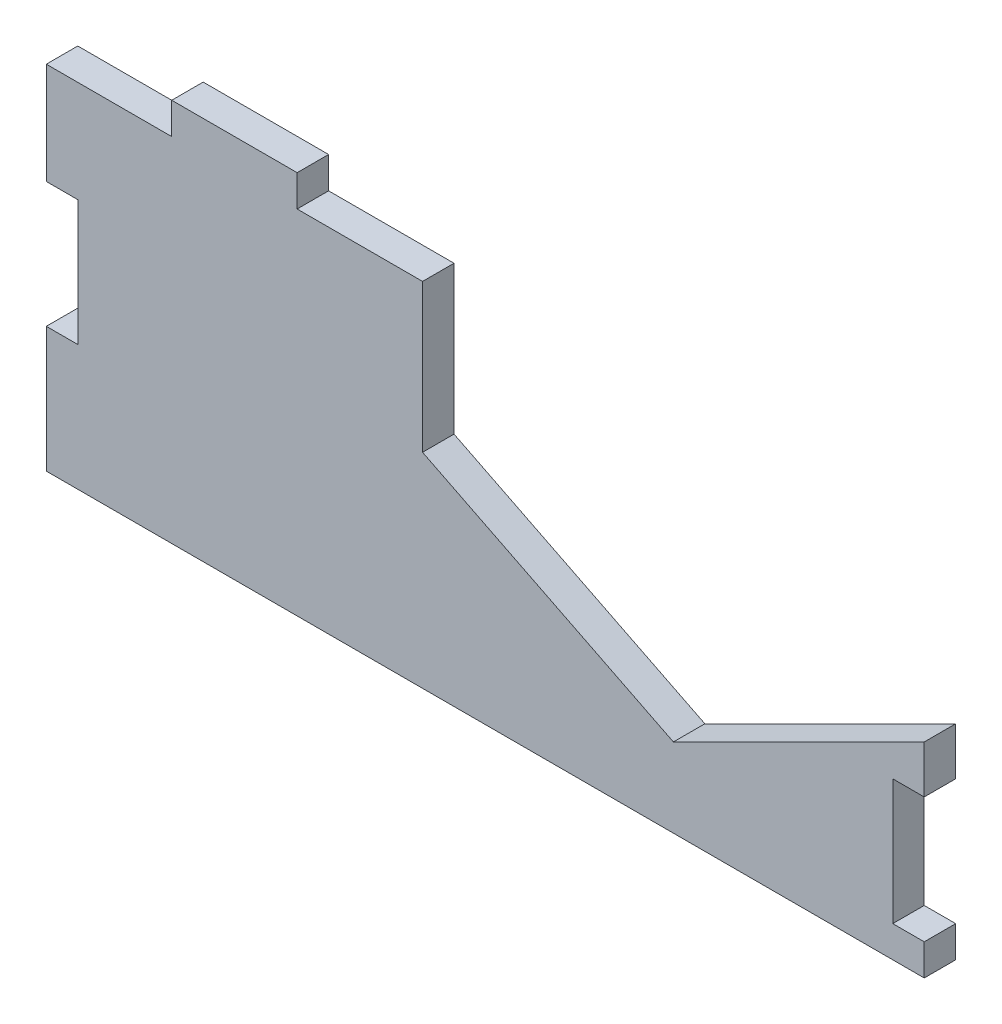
ISO-10303-21;
HEADER;
FILE_DESCRIPTION(('STEP AP214'),'2;1');
FILE_NAME('part.step','',(''),(''),'','','');
FILE_SCHEMA(('AUTOMOTIVE_DESIGN { 1 0 10303 214 1 1 1 1 }'));
ENDSEC;
DATA;
#1=APPLICATION_CONTEXT('core data for automotive mechanical design processes');
#2=APPLICATION_PROTOCOL_DEFINITION('international standard','automotive_design',2000,#1);
#3=PRODUCT_CONTEXT('',#1,'mechanical');
#4=PRODUCT('Part','Part','',(#3));
#5=PRODUCT_RELATED_PRODUCT_CATEGORY('part','',(#4));
#6=PRODUCT_DEFINITION_FORMATION('','',#4);
#7=PRODUCT_DEFINITION_CONTEXT('part definition',#1,'design');
#8=PRODUCT_DEFINITION('design','',#6,#7);
#9=PRODUCT_DEFINITION_SHAPE('','',#8);
#10=(LENGTH_UNIT() NAMED_UNIT(*) SI_UNIT(.MILLI.,.METRE.));
#11=(NAMED_UNIT(*) PLANE_ANGLE_UNIT() SI_UNIT($,.RADIAN.));
#12=(NAMED_UNIT(*) SI_UNIT($,.STERADIAN.) SOLID_ANGLE_UNIT());
#13=UNCERTAINTY_MEASURE_WITH_UNIT(LENGTH_MEASURE(1.E-05),#10,'distance_accuracy_value','');
#14=(GEOMETRIC_REPRESENTATION_CONTEXT(3) GLOBAL_UNCERTAINTY_ASSIGNED_CONTEXT((#13)) GLOBAL_UNIT_ASSIGNED_CONTEXT((#10,
#11,#12)) REPRESENTATION_CONTEXT('',''));
#15=CARTESIAN_POINT('',(0.,0.,0.));
#16=DIRECTION('',(0.,0.,1.));
#17=DIRECTION('',(1.,0.,0.));
#18=AXIS2_PLACEMENT_3D('',#15,#16,#17);
#19=CARTESIAN_POINT('',(89.0643455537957,353.134265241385,19.));
#20=DIRECTION('',(-1.,0.,0.));
#21=DIRECTION('',(0.,-1.,0.));
#22=AXIS2_PLACEMENT_3D('',#19,#20,#21);
#23=PLANE('',#22);
#24=DIRECTION('',(0.,1.,0.));
#25=VECTOR('',#24,1.);
#26=CARTESIAN_POINT('',(89.0643455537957,353.134265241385,0.));
#27=LINE('',#26,#25);
#28=CARTESIAN_POINT('',(89.0643455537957,324.362836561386,0.));
#29=VERTEX_POINT('',#28);
#30=CARTESIAN_POINT('',(89.0643455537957,353.134265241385,0.));
#31=VERTEX_POINT('',#30);
#32=EDGE_CURVE('E194',#29,#31,#27,.T.);
#33=ORIENTED_EDGE('',*,*,#32,.T.);
#34=DIRECTION('',(0.,0.,-1.));
#35=VECTOR('',#34,1.);
#36=CARTESIAN_POINT('',(89.0643455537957,353.134265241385,19.));
#37=LINE('',#36,#35);
#38=CARTESIAN_POINT('',(89.0643455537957,353.134265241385,19.));
#39=VERTEX_POINT('',#38);
#40=EDGE_CURVE('E11',#39,#31,#37,.T.);
#41=ORIENTED_EDGE('',*,*,#40,.F.);
#42=DIRECTION('',(0.,1.,0.));
#43=VECTOR('',#42,1.);
#44=CARTESIAN_POINT('',(89.0643455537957,353.134265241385,19.));
#45=LINE('',#44,#43);
#46=CARTESIAN_POINT('',(89.0643455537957,324.362836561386,19.));
#47=VERTEX_POINT('',#46);
#48=EDGE_CURVE('E230',#47,#39,#45,.T.);
#49=ORIENTED_EDGE('',*,*,#48,.F.);
#50=DIRECTION('',(0.,0.,-1.));
#51=VECTOR('',#50,1.);
#52=CARTESIAN_POINT('',(89.0643455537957,324.362836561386,19.));
#53=LINE('',#52,#51);
#54=EDGE_CURVE('E190',#47,#29,#53,.T.);
#55=ORIENTED_EDGE('',*,*,#54,.T.);
#56=EDGE_LOOP('',(#33,#41,#49,#55));
#57=FACE_BOUND('',#56,.T.);
#58=ADVANCED_FACE('F32',(#57),#23,.F.);
#59=CARTESIAN_POINT('',(89.0643455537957,353.134265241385,19.));
#60=DIRECTION('',(0.447213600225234,-0.894427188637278,0.));
#61=DIRECTION('',(0.894427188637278,0.447213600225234,0.));
#62=AXIS2_PLACEMENT_3D('',#59,#60,#61);
#63=PLANE('',#62);
#64=DIRECTION('',(-0.894427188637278,-0.447213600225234,0.));
#65=VECTOR('',#64,1.);
#66=CARTESIAN_POINT('',(89.0643455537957,353.134265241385,0.));
#67=LINE('',#66,#65);
#68=CARTESIAN_POINT('',(-62.3642244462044,277.419979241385,0.));
#69=VERTEX_POINT('',#68);
#70=EDGE_CURVE('E197',#31,#69,#67,.T.);
#71=ORIENTED_EDGE('',*,*,#70,.T.);
#72=DIRECTION('',(0.,0.,-1.));
#73=VECTOR('',#72,1.);
#74=CARTESIAN_POINT('',(-62.3642244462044,277.419979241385,19.));
#75=LINE('',#74,#73);
#76=CARTESIAN_POINT('',(-62.3642244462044,277.419979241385,19.));
#77=VERTEX_POINT('',#76);
#78=EDGE_CURVE('E40',#77,#69,#75,.T.);
#79=ORIENTED_EDGE('',*,*,#78,.F.);
#80=DIRECTION('',(-0.894427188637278,-0.447213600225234,0.));
#81=VECTOR('',#80,1.);
#82=CARTESIAN_POINT('',(89.0643455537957,353.134265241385,19.));
#83=LINE('',#82,#81);
#84=EDGE_CURVE('E124',#39,#77,#83,.T.);
#85=ORIENTED_EDGE('',*,*,#84,.F.);
#86=ORIENTED_EDGE('',*,*,#40,.T.);
#87=EDGE_LOOP('',(#71,#79,#85,#86));
#88=FACE_BOUND('',#87,.T.);
#89=ADVANCED_FACE('F343',(#88),#63,.F.);
#90=CARTESIAN_POINT('',(-213.792796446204,353.134265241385,19.));
#91=DIRECTION('',(-0.447213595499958,-0.894427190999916,0.));
#92=DIRECTION('',(0.894427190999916,-0.447213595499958,0.));
#93=AXIS2_PLACEMENT_3D('',#90,#91,#92);
#94=PLANE('',#93);
#95=DIRECTION('',(-0.894427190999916,0.447213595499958,0.));
#96=VECTOR('',#95,1.);
#97=CARTESIAN_POINT('',(-213.792796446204,353.134265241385,0.));
#98=LINE('',#97,#96);
#99=CARTESIAN_POINT('',(-213.792796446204,353.134265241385,0.));
#100=VERTEX_POINT('',#99);
#101=EDGE_CURVE('E199',#69,#100,#98,.T.);
#102=ORIENTED_EDGE('',*,*,#101,.T.);
#103=DIRECTION('',(0.,0.,-1.));
#104=VECTOR('',#103,1.);
#105=CARTESIAN_POINT('',(-213.792796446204,353.134265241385,19.));
#106=LINE('',#105,#104);
#107=CARTESIAN_POINT('',(-213.792796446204,353.134265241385,19.));
#108=VERTEX_POINT('',#107);
#109=EDGE_CURVE('E270',#108,#100,#106,.T.);
#110=ORIENTED_EDGE('',*,*,#109,.F.);
#111=DIRECTION('',(-0.894427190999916,0.447213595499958,0.));
#112=VECTOR('',#111,1.);
#113=CARTESIAN_POINT('',(-213.792796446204,353.134265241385,19.));
#114=LINE('',#113,#112);
#115=EDGE_CURVE('E278',#77,#108,#114,.T.);
#116=ORIENTED_EDGE('',*,*,#115,.F.);
#117=ORIENTED_EDGE('',*,*,#78,.T.);
#118=EDGE_LOOP('',(#102,#110,#116,#117));
#119=FACE_BOUND('',#118,.T.);
#120=ADVANCED_FACE('F276',(#119),#94,.F.);
#121=CARTESIAN_POINT('',(-213.792796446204,442.477122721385,19.));
#122=DIRECTION('',(-1.,0.,0.));
#123=DIRECTION('',(0.,-1.,0.));
#124=AXIS2_PLACEMENT_3D('',#121,#122,#123);
#125=PLANE('',#124);
#126=DIRECTION('',(0.,1.,0.));
#127=VECTOR('',#126,1.);
#128=CARTESIAN_POINT('',(-213.792796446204,442.477122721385,0.));
#129=LINE('',#128,#127);
#130=CARTESIAN_POINT('',(-213.792796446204,442.477122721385,0.));
#131=VERTEX_POINT('',#130);
#132=EDGE_CURVE('E201',#100,#131,#129,.T.);
#133=ORIENTED_EDGE('',*,*,#132,.T.);
#134=DIRECTION('',(0.,0.,-1.));
#135=VECTOR('',#134,1.);
#136=CARTESIAN_POINT('',(-213.792796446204,442.477122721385,19.));
#137=LINE('',#136,#135);
#138=CARTESIAN_POINT('',(-213.792796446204,442.477122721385,19.));
#139=VERTEX_POINT('',#138);
#140=EDGE_CURVE('E267',#139,#131,#137,.T.);
#141=ORIENTED_EDGE('',*,*,#140,.F.);
#142=DIRECTION('',(0.,1.,0.));
#143=VECTOR('',#142,1.);
#144=CARTESIAN_POINT('',(-213.792796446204,442.477122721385,19.));
#145=LINE('',#144,#143);
#146=EDGE_CURVE('E296',#108,#139,#145,.T.);
#147=ORIENTED_EDGE('',*,*,#146,.F.);
#148=ORIENTED_EDGE('',*,*,#109,.T.);
#149=EDGE_LOOP('',(#133,#141,#147,#148));
#150=FACE_BOUND('',#149,.T.);
#151=ADVANCED_FACE('F287',(#150),#125,.F.);
#152=CARTESIAN_POINT('',(-289.507082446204,442.477122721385,19.));
#153=DIRECTION('',(0.,-1.,0.));
#154=DIRECTION('',(0.,0.,-1.));
#155=AXIS2_PLACEMENT_3D('',#152,#153,#154);
#156=PLANE('',#155);
#157=DIRECTION('',(-1.,0.,0.));
#158=VECTOR('',#157,1.);
#159=CARTESIAN_POINT('',(-289.507082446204,442.477122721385,0.));
#160=LINE('',#159,#158);
#161=CARTESIAN_POINT('',(-289.507082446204,442.477122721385,0.));
#162=VERTEX_POINT('',#161);
#163=EDGE_CURVE('E203',#131,#162,#160,.T.);
#164=ORIENTED_EDGE('',*,*,#163,.T.);
#165=DIRECTION('',(0.,0.,-1.));
#166=VECTOR('',#165,1.);
#167=CARTESIAN_POINT('',(-289.507082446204,442.477122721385,19.));
#168=LINE('',#167,#166);
#169=CARTESIAN_POINT('',(-289.507082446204,442.477122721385,19.));
#170=VERTEX_POINT('',#169);
#171=EDGE_CURVE('E264',#170,#162,#168,.T.);
#172=ORIENTED_EDGE('',*,*,#171,.F.);
#173=DIRECTION('',(-1.,0.,0.));
#174=VECTOR('',#173,1.);
#175=CARTESIAN_POINT('',(-289.507082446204,442.477122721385,19.));
#176=LINE('',#175,#174);
#177=EDGE_CURVE('E293',#139,#170,#176,.T.);
#178=ORIENTED_EDGE('',*,*,#177,.F.);
#179=ORIENTED_EDGE('',*,*,#140,.T.);
#180=EDGE_LOOP('',(#164,#172,#178,#179));
#181=FACE_BOUND('',#180,.T.);
#182=ADVANCED_FACE('F291',(#181),#156,.F.);
#183=CARTESIAN_POINT('',(-289.507082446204,461.477122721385,19.));
#184=DIRECTION('',(-1.,0.,0.));
#185=DIRECTION('',(0.,0.,1.));
#186=AXIS2_PLACEMENT_3D('',#183,#184,#185);
#187=PLANE('',#186);
#188=DIRECTION('',(0.,1.,0.));
#189=VECTOR('',#188,1.);
#190=CARTESIAN_POINT('',(-289.507082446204,461.477122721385,0.));
#191=LINE('',#190,#189);
#192=CARTESIAN_POINT('',(-289.507082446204,461.477122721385,0.));
#193=VERTEX_POINT('',#192);
#194=EDGE_CURVE('E205',#162,#193,#191,.T.);
#195=ORIENTED_EDGE('',*,*,#194,.T.);
#196=DIRECTION('',(0.,0.,-1.));
#197=VECTOR('',#196,1.);
#198=CARTESIAN_POINT('',(-289.507082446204,461.477122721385,19.));
#199=LINE('',#198,#197);
#200=CARTESIAN_POINT('',(-289.507082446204,461.477122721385,19.));
#201=VERTEX_POINT('',#200);
#202=EDGE_CURVE('E261',#201,#193,#199,.T.);
#203=ORIENTED_EDGE('',*,*,#202,.F.);
#204=DIRECTION('',(0.,1.,0.));
#205=VECTOR('',#204,1.);
#206=CARTESIAN_POINT('',(-289.507082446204,461.477122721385,19.));
#207=LINE('',#206,#205);
#208=EDGE_CURVE('E295',#170,#201,#207,.T.);
#209=ORIENTED_EDGE('',*,*,#208,.F.);
#210=ORIENTED_EDGE('',*,*,#171,.T.);
#211=EDGE_LOOP('',(#195,#203,#209,#210));
#212=FACE_BOUND('',#211,.T.);
#213=ADVANCED_FACE('F356',(#212),#187,.F.);
#214=CARTESIAN_POINT('',(-365.221368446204,461.477122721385,19.));
#215=DIRECTION('',(0.,-1.,0.));
#216=DIRECTION('',(0.,0.,-1.));
#217=AXIS2_PLACEMENT_3D('',#214,#215,#216);
#218=PLANE('',#217);
#219=DIRECTION('',(-1.,0.,0.));
#220=VECTOR('',#219,1.);
#221=CARTESIAN_POINT('',(-365.221368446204,461.477122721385,0.));
#222=LINE('',#221,#220);
#223=CARTESIAN_POINT('',(-365.221368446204,461.477122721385,0.));
#224=VERTEX_POINT('',#223);
#225=EDGE_CURVE('E207',#193,#224,#222,.T.);
#226=ORIENTED_EDGE('',*,*,#225,.T.);
#227=DIRECTION('',(0.,0.,-1.));
#228=VECTOR('',#227,1.);
#229=CARTESIAN_POINT('',(-365.221368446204,461.477122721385,19.));
#230=LINE('',#229,#228);
#231=CARTESIAN_POINT('',(-365.221368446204,461.477122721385,19.));
#232=VERTEX_POINT('',#231);
#233=EDGE_CURVE('E258',#232,#224,#230,.T.);
#234=ORIENTED_EDGE('',*,*,#233,.F.);
#235=DIRECTION('',(-1.,0.,0.));
#236=VECTOR('',#235,1.);
#237=CARTESIAN_POINT('',(-365.221368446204,461.477122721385,19.));
#238=LINE('',#237,#236);
#239=EDGE_CURVE('E298',#201,#232,#238,.T.);
#240=ORIENTED_EDGE('',*,*,#239,.F.);
#241=ORIENTED_EDGE('',*,*,#202,.T.);
#242=EDGE_LOOP('',(#226,#234,#240,#241));
#243=FACE_BOUND('',#242,.T.);
#244=ADVANCED_FACE('F359',(#243),#218,.F.);
#245=CARTESIAN_POINT('',(-365.221368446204,461.477122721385,19.));
#246=DIRECTION('',(1.,0.,0.));
#247=DIRECTION('',(0.,0.,-1.));
#248=AXIS2_PLACEMENT_3D('',#245,#246,#247);
#249=PLANE('',#248);
#250=DIRECTION('',(0.,-1.,0.));
#251=VECTOR('',#250,1.);
#252=CARTESIAN_POINT('',(-365.221368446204,461.477122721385,0.));
#253=LINE('',#252,#251);
#254=CARTESIAN_POINT('',(-365.221368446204,442.477122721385,0.));
#255=VERTEX_POINT('',#254);
#256=EDGE_CURVE('E209',#224,#255,#253,.T.);
#257=ORIENTED_EDGE('',*,*,#256,.T.);
#258=DIRECTION('',(0.,0.,-1.));
#259=VECTOR('',#258,1.);
#260=CARTESIAN_POINT('',(-365.221368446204,442.477122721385,19.));
#261=LINE('',#260,#259);
#262=CARTESIAN_POINT('',(-365.221368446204,442.477122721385,19.));
#263=VERTEX_POINT('',#262);
#264=EDGE_CURVE('E255',#263,#255,#261,.T.);
#265=ORIENTED_EDGE('',*,*,#264,.F.);
#266=DIRECTION('',(0.,-1.,0.));
#267=VECTOR('',#266,1.);
#268=CARTESIAN_POINT('',(-365.221368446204,461.477122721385,19.));
#269=LINE('',#268,#267);
#270=EDGE_CURVE('E304',#232,#263,#269,.T.);
#271=ORIENTED_EDGE('',*,*,#270,.F.);
#272=ORIENTED_EDGE('',*,*,#233,.T.);
#273=EDGE_LOOP('',(#257,#265,#271,#272));
#274=FACE_BOUND('',#273,.T.);
#275=ADVANCED_FACE('F363',(#274),#249,.F.);
#276=CARTESIAN_POINT('',(-440.935654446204,442.477122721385,19.));
#277=DIRECTION('',(0.,-1.,0.));
#278=DIRECTION('',(0.,0.,-1.));
#279=AXIS2_PLACEMENT_3D('',#276,#277,#278);
#280=PLANE('',#279);
#281=DIRECTION('',(-1.,0.,0.));
#282=VECTOR('',#281,1.);
#283=CARTESIAN_POINT('',(-440.935654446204,442.477122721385,0.));
#284=LINE('',#283,#282);
#285=CARTESIAN_POINT('',(-440.935654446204,442.477122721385,0.));
#286=VERTEX_POINT('',#285);
#287=EDGE_CURVE('E211',#255,#286,#284,.T.);
#288=ORIENTED_EDGE('',*,*,#287,.T.);
#289=DIRECTION('',(0.,0.,-1.));
#290=VECTOR('',#289,1.);
#291=CARTESIAN_POINT('',(-440.935654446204,442.477122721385,19.));
#292=LINE('',#291,#290);
#293=CARTESIAN_POINT('',(-440.935654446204,442.477122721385,19.));
#294=VERTEX_POINT('',#293);
#295=EDGE_CURVE('E252',#294,#286,#292,.T.);
#296=ORIENTED_EDGE('',*,*,#295,.F.);
#297=DIRECTION('',(-1.,0.,0.));
#298=VECTOR('',#297,1.);
#299=CARTESIAN_POINT('',(-440.935654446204,442.477122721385,19.));
#300=LINE('',#299,#298);
#301=EDGE_CURVE('E306',#263,#294,#300,.T.);
#302=ORIENTED_EDGE('',*,*,#301,.F.);
#303=ORIENTED_EDGE('',*,*,#264,.T.);
#304=EDGE_LOOP('',(#288,#296,#302,#303));
#305=FACE_BOUND('',#304,.T.);
#306=ADVANCED_FACE('F367',(#305),#280,.F.);
#307=CARTESIAN_POINT('',(-440.935654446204,442.477122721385,19.));
#308=DIRECTION('',(1.,0.,0.));
#309=DIRECTION('',(0.,0.,-1.));
#310=AXIS2_PLACEMENT_3D('',#307,#308,#309);
#311=PLANE('',#310);
#312=DIRECTION('',(0.,-1.,0.));
#313=VECTOR('',#312,1.);
#314=CARTESIAN_POINT('',(-440.935654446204,442.477122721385,0.));
#315=LINE('',#314,#313);
#316=CARTESIAN_POINT('',(-440.935654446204,381.148551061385,0.));
#317=VERTEX_POINT('',#316);
#318=EDGE_CURVE('E213',#286,#317,#315,.T.);
#319=ORIENTED_EDGE('',*,*,#318,.T.);
#320=DIRECTION('',(0.,0.,-1.));
#321=VECTOR('',#320,1.);
#322=CARTESIAN_POINT('',(-440.935654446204,381.148551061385,19.));
#323=LINE('',#322,#321);
#324=CARTESIAN_POINT('',(-440.935654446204,381.148551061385,19.));
#325=VERTEX_POINT('',#324);
#326=EDGE_CURVE('E249',#325,#317,#323,.T.);
#327=ORIENTED_EDGE('',*,*,#326,.F.);
#328=DIRECTION('',(0.,-1.,0.));
#329=VECTOR('',#328,1.);
#330=CARTESIAN_POINT('',(-440.935654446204,442.477122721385,19.));
#331=LINE('',#330,#329);
#332=EDGE_CURVE('E308',#294,#325,#331,.T.);
#333=ORIENTED_EDGE('',*,*,#332,.F.);
#334=ORIENTED_EDGE('',*,*,#295,.T.);
#335=EDGE_LOOP('',(#319,#327,#333,#334));
#336=FACE_BOUND('',#335,.T.);
#337=ADVANCED_FACE('F371',(#336),#311,.F.);
#338=CARTESIAN_POINT('',(-440.935654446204,381.148551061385,19.));
#339=DIRECTION('',(0.,1.,0.));
#340=DIRECTION('',(0.,0.,1.));
#341=AXIS2_PLACEMENT_3D('',#338,#339,#340);
#342=PLANE('',#341);
#343=DIRECTION('',(1.,0.,0.));
#344=VECTOR('',#343,1.);
#345=CARTESIAN_POINT('',(-440.935654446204,381.148551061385,0.));
#346=LINE('',#345,#344);
#347=CARTESIAN_POINT('',(-421.935654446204,381.148551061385,0.));
#348=VERTEX_POINT('',#347);
#349=EDGE_CURVE('E215',#317,#348,#346,.T.);
#350=ORIENTED_EDGE('',*,*,#349,.T.);
#351=DIRECTION('',(0.,0.,-1.));
#352=VECTOR('',#351,1.);
#353=CARTESIAN_POINT('',(-421.935654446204,381.148551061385,19.));
#354=LINE('',#353,#352);
#355=CARTESIAN_POINT('',(-421.935654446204,381.148551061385,19.));
#356=VERTEX_POINT('',#355);
#357=EDGE_CURVE('E246',#356,#348,#354,.T.);
#358=ORIENTED_EDGE('',*,*,#357,.F.);
#359=DIRECTION('',(1.,0.,0.));
#360=VECTOR('',#359,1.);
#361=CARTESIAN_POINT('',(-440.935654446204,381.148551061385,19.));
#362=LINE('',#361,#360);
#363=EDGE_CURVE('E310',#325,#356,#362,.T.);
#364=ORIENTED_EDGE('',*,*,#363,.F.);
#365=ORIENTED_EDGE('',*,*,#326,.T.);
#366=EDGE_LOOP('',(#350,#358,#364,#365));
#367=FACE_BOUND('',#366,.T.);
#368=ADVANCED_FACE('F375',(#367),#342,.F.);
#369=CARTESIAN_POINT('',(-421.935654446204,381.148551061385,19.));
#370=DIRECTION('',(1.,0.,0.));
#371=DIRECTION('',(0.,0.,-1.));
#372=AXIS2_PLACEMENT_3D('',#369,#370,#371);
#373=PLANE('',#372);
#374=DIRECTION('',(0.,-1.,0.));
#375=VECTOR('',#374,1.);
#376=CARTESIAN_POINT('',(-421.935654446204,381.148551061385,0.));
#377=LINE('',#376,#375);
#378=CARTESIAN_POINT('',(-421.935654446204,305.434265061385,0.));
#379=VERTEX_POINT('',#378);
#380=EDGE_CURVE('E217',#348,#379,#377,.T.);
#381=ORIENTED_EDGE('',*,*,#380,.T.);
#382=DIRECTION('',(0.,0.,-1.));
#383=VECTOR('',#382,1.);
#384=CARTESIAN_POINT('',(-421.935654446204,305.434265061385,19.));
#385=LINE('',#384,#383);
#386=CARTESIAN_POINT('',(-421.935654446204,305.434265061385,19.));
#387=VERTEX_POINT('',#386);
#388=EDGE_CURVE('E243',#387,#379,#385,.T.);
#389=ORIENTED_EDGE('',*,*,#388,.F.);
#390=DIRECTION('',(0.,-1.,0.));
#391=VECTOR('',#390,1.);
#392=CARTESIAN_POINT('',(-421.935654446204,381.148551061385,19.));
#393=LINE('',#392,#391);
#394=EDGE_CURVE('E312',#356,#387,#393,.T.);
#395=ORIENTED_EDGE('',*,*,#394,.F.);
#396=ORIENTED_EDGE('',*,*,#357,.T.);
#397=EDGE_LOOP('',(#381,#389,#395,#396));
#398=FACE_BOUND('',#397,.T.);
#399=ADVANCED_FACE('F379',(#398),#373,.F.);
#400=CARTESIAN_POINT('',(-440.935654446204,305.434265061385,19.));
#401=DIRECTION('',(0.,-1.,0.));
#402=DIRECTION('',(0.,0.,-1.));
#403=AXIS2_PLACEMENT_3D('',#400,#401,#402);
#404=PLANE('',#403);
#405=DIRECTION('',(-1.,0.,0.));
#406=VECTOR('',#405,1.);
#407=CARTESIAN_POINT('',(-440.935654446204,305.434265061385,0.));
#408=LINE('',#407,#406);
#409=CARTESIAN_POINT('',(-440.935654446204,305.434265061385,0.));
#410=VERTEX_POINT('',#409);
#411=EDGE_CURVE('E219',#379,#410,#408,.T.);
#412=ORIENTED_EDGE('',*,*,#411,.T.);
#413=DIRECTION('',(0.,0.,-1.));
#414=VECTOR('',#413,1.);
#415=CARTESIAN_POINT('',(-440.935654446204,305.434265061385,19.));
#416=LINE('',#415,#414);
#417=CARTESIAN_POINT('',(-440.935654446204,305.434265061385,19.));
#418=VERTEX_POINT('',#417);
#419=EDGE_CURVE('E240',#418,#410,#416,.T.);
#420=ORIENTED_EDGE('',*,*,#419,.F.);
#421=DIRECTION('',(-1.,0.,0.));
#422=VECTOR('',#421,1.);
#423=CARTESIAN_POINT('',(-440.935654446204,305.434265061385,19.));
#424=LINE('',#423,#422);
#425=EDGE_CURVE('E314',#387,#418,#424,.T.);
#426=ORIENTED_EDGE('',*,*,#425,.F.);
#427=ORIENTED_EDGE('',*,*,#388,.T.);
#428=EDGE_LOOP('',(#412,#420,#426,#427));
#429=FACE_BOUND('',#428,.T.);
#430=ADVANCED_FACE('F383',(#429),#404,.F.);
#431=CARTESIAN_POINT('',(-440.935654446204,305.434265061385,19.));
#432=DIRECTION('',(1.,0.,0.));
#433=DIRECTION('',(0.,0.,-1.));
#434=AXIS2_PLACEMENT_3D('',#431,#432,#433);
#435=PLANE('',#434);
#436=DIRECTION('',(0.,-1.,0.));
#437=VECTOR('',#436,1.);
#438=CARTESIAN_POINT('',(-440.935654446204,305.434265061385,0.));
#439=LINE('',#438,#437);
#440=CARTESIAN_POINT('',(-440.935654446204,229.719979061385,0.));
#441=VERTEX_POINT('',#440);
#442=EDGE_CURVE('E221',#410,#441,#439,.T.);
#443=ORIENTED_EDGE('',*,*,#442,.T.);
#444=DIRECTION('',(0.,0.,-1.));
#445=VECTOR('',#444,1.);
#446=CARTESIAN_POINT('',(-440.935654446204,229.719979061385,19.));
#447=LINE('',#446,#445);
#448=CARTESIAN_POINT('',(-440.935654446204,229.719979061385,19.));
#449=VERTEX_POINT('',#448);
#450=EDGE_CURVE('E237',#449,#441,#447,.T.);
#451=ORIENTED_EDGE('',*,*,#450,.F.);
#452=DIRECTION('',(0.,-1.,0.));
#453=VECTOR('',#452,1.);
#454=CARTESIAN_POINT('',(-440.935654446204,305.434265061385,19.));
#455=LINE('',#454,#453);
#456=EDGE_CURVE('E316',#418,#449,#455,.T.);
#457=ORIENTED_EDGE('',*,*,#456,.F.);
#458=ORIENTED_EDGE('',*,*,#419,.T.);
#459=EDGE_LOOP('',(#443,#451,#457,#458));
#460=FACE_BOUND('',#459,.T.);
#461=ADVANCED_FACE('F387',(#460),#435,.F.);
#462=CARTESIAN_POINT('',(-440.935654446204,229.719979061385,19.));
#463=DIRECTION('',(0.,1.,0.));
#464=DIRECTION('',(0.,0.,1.));
#465=AXIS2_PLACEMENT_3D('',#462,#463,#464);
#466=PLANE('',#465);
#467=DIRECTION('',(1.,0.,0.));
#468=VECTOR('',#467,1.);
#469=CARTESIAN_POINT('',(-440.935654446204,229.719979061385,0.));
#470=LINE('',#469,#468);
#471=CARTESIAN_POINT('',(89.0643455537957,229.719979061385,0.));
#472=VERTEX_POINT('',#471);
#473=EDGE_CURVE('E223',#441,#472,#470,.T.);
#474=ORIENTED_EDGE('',*,*,#473,.T.);
#475=DIRECTION('',(0.,0.,-1.));
#476=VECTOR('',#475,1.);
#477=CARTESIAN_POINT('',(89.0643455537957,229.719979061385,19.));
#478=LINE('',#477,#476);
#479=CARTESIAN_POINT('',(89.0643455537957,229.719979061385,19.));
#480=VERTEX_POINT('',#479);
#481=EDGE_CURVE('E234',#480,#472,#478,.T.);
#482=ORIENTED_EDGE('',*,*,#481,.F.);
#483=DIRECTION('',(1.,0.,0.));
#484=VECTOR('',#483,1.);
#485=CARTESIAN_POINT('',(-440.935654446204,229.719979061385,19.));
#486=LINE('',#485,#484);
#487=EDGE_CURVE('E318',#449,#480,#486,.T.);
#488=ORIENTED_EDGE('',*,*,#487,.F.);
#489=ORIENTED_EDGE('',*,*,#450,.T.);
#490=EDGE_LOOP('',(#474,#482,#488,#489));
#491=FACE_BOUND('',#490,.T.);
#492=ADVANCED_FACE('F324',(#491),#466,.F.);
#493=CARTESIAN_POINT('',(89.0643455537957,248.648550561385,19.));
#494=DIRECTION('',(-1.,0.,0.));
#495=DIRECTION('',(0.,0.,1.));
#496=AXIS2_PLACEMENT_3D('',#493,#494,#495);
#497=PLANE('',#496);
#498=DIRECTION('',(0.,1.,0.));
#499=VECTOR('',#498,1.);
#500=CARTESIAN_POINT('',(89.0643455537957,248.648550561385,0.));
#501=LINE('',#500,#499);
#502=CARTESIAN_POINT('',(89.0643455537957,248.648550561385,0.));
#503=VERTEX_POINT('',#502);
#504=EDGE_CURVE('E225',#472,#503,#501,.T.);
#505=ORIENTED_EDGE('',*,*,#504,.T.);
#506=DIRECTION('',(0.,0.,-1.));
#507=VECTOR('',#506,1.);
#508=CARTESIAN_POINT('',(89.0643455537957,248.648550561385,19.));
#509=LINE('',#508,#507);
#510=CARTESIAN_POINT('',(89.0643455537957,248.648550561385,19.));
#511=VERTEX_POINT('',#510);
#512=EDGE_CURVE('E185',#511,#503,#509,.T.);
#513=ORIENTED_EDGE('',*,*,#512,.F.);
#514=DIRECTION('',(0.,1.,0.));
#515=VECTOR('',#514,1.);
#516=CARTESIAN_POINT('',(89.0643455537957,248.648550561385,19.));
#517=LINE('',#516,#515);
#518=EDGE_CURVE('E176',#480,#511,#517,.T.);
#519=ORIENTED_EDGE('',*,*,#518,.F.);
#520=ORIENTED_EDGE('',*,*,#481,.T.);
#521=EDGE_LOOP('',(#505,#513,#519,#520));
#522=FACE_BOUND('',#521,.T.);
#523=ADVANCED_FACE('F328',(#522),#497,.F.);
#524=CARTESIAN_POINT('',(70.0643455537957,248.648550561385,19.));
#525=DIRECTION('',(0.,-1.,0.));
#526=DIRECTION('',(0.,0.,-1.));
#527=AXIS2_PLACEMENT_3D('',#524,#525,#526);
#528=PLANE('',#527);
#529=DIRECTION('',(-1.,0.,0.));
#530=VECTOR('',#529,1.);
#531=CARTESIAN_POINT('',(70.0643455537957,248.648550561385,0.));
#532=LINE('',#531,#530);
#533=CARTESIAN_POINT('',(70.0643455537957,248.648550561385,0.));
#534=VERTEX_POINT('',#533);
#535=EDGE_CURVE('E184',#503,#534,#532,.T.);
#536=ORIENTED_EDGE('',*,*,#535,.T.);
#537=DIRECTION('',(0.,0.,-1.));
#538=VECTOR('',#537,1.);
#539=CARTESIAN_POINT('',(70.0643455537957,248.648550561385,19.));
#540=LINE('',#539,#538);
#541=CARTESIAN_POINT('',(70.0643455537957,248.648550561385,19.));
#542=VERTEX_POINT('',#541);
#543=EDGE_CURVE('E181',#542,#534,#540,.T.);
#544=ORIENTED_EDGE('',*,*,#543,.F.);
#545=DIRECTION('',(-1.,0.,0.));
#546=VECTOR('',#545,1.);
#547=CARTESIAN_POINT('',(70.0643455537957,248.648550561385,19.));
#548=LINE('',#547,#546);
#549=EDGE_CURVE('E170',#511,#542,#548,.T.);
#550=ORIENTED_EDGE('',*,*,#549,.F.);
#551=ORIENTED_EDGE('',*,*,#512,.T.);
#552=EDGE_LOOP('',(#536,#544,#550,#551));
#553=FACE_BOUND('',#552,.T.);
#554=ADVANCED_FACE('F182',(#553),#528,.F.);
#555=CARTESIAN_POINT('',(70.0643455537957,324.362836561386,19.));
#556=DIRECTION('',(-1.,0.,0.));
#557=DIRECTION('',(0.,-1.,0.));
#558=AXIS2_PLACEMENT_3D('',#555,#556,#557);
#559=PLANE('',#558);
#560=DIRECTION('',(0.,1.,0.));
#561=VECTOR('',#560,1.);
#562=CARTESIAN_POINT('',(70.0643455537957,324.362836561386,0.));
#563=LINE('',#562,#561);
#564=CARTESIAN_POINT('',(70.0643455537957,324.362836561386,0.));
#565=VERTEX_POINT('',#564);
#566=EDGE_CURVE('E110',#534,#565,#563,.T.);
#567=ORIENTED_EDGE('',*,*,#566,.T.);
#568=DIRECTION('',(0.,0.,-1.));
#569=VECTOR('',#568,1.);
#570=CARTESIAN_POINT('',(70.0643455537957,324.362836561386,19.));
#571=LINE('',#570,#569);
#572=CARTESIAN_POINT('',(70.0643455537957,324.362836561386,19.));
#573=VERTEX_POINT('',#572);
#574=EDGE_CURVE('E186',#573,#565,#571,.T.);
#575=ORIENTED_EDGE('',*,*,#574,.F.);
#576=DIRECTION('',(0.,1.,0.));
#577=VECTOR('',#576,1.);
#578=CARTESIAN_POINT('',(70.0643455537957,324.362836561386,19.));
#579=LINE('',#578,#577);
#580=EDGE_CURVE('E174',#542,#573,#579,.T.);
#581=ORIENTED_EDGE('',*,*,#580,.F.);
#582=ORIENTED_EDGE('',*,*,#543,.T.);
#583=EDGE_LOOP('',(#567,#575,#581,#582));
#584=FACE_BOUND('',#583,.T.);
#585=ADVANCED_FACE('F188',(#584),#559,.F.);
#586=CARTESIAN_POINT('',(70.0643455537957,324.362836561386,19.));
#587=DIRECTION('',(0.,1.,0.));
#588=DIRECTION('',(0.,0.,1.));
#589=AXIS2_PLACEMENT_3D('',#586,#587,#588);
#590=PLANE('',#589);
#591=DIRECTION('',(1.,0.,0.));
#592=VECTOR('',#591,1.);
#593=CARTESIAN_POINT('',(70.0643455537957,324.362836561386,0.));
#594=LINE('',#593,#592);
#595=EDGE_CURVE('E116',#565,#29,#594,.T.);
#596=ORIENTED_EDGE('',*,*,#595,.T.);
#597=ORIENTED_EDGE('',*,*,#54,.F.);
#598=DIRECTION('',(1.,0.,0.));
#599=VECTOR('',#598,1.);
#600=CARTESIAN_POINT('',(70.0643455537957,324.362836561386,19.));
#601=LINE('',#600,#599);
#602=EDGE_CURVE('E48',#573,#47,#601,.T.);
#603=ORIENTED_EDGE('',*,*,#602,.F.);
#604=ORIENTED_EDGE('',*,*,#574,.T.);
#605=EDGE_LOOP('',(#596,#597,#603,#604));
#606=FACE_BOUND('',#605,.T.);
#607=ADVANCED_FACE('F332',(#606),#590,.F.);
#608=CARTESIAN_POINT('',(0.,0.,19.));
#609=DIRECTION('',(0.,0.,1.));
#610=DIRECTION('',(1.,0.,0.));
#611=AXIS2_PLACEMENT_3D('',#608,#609,#610);
#612=PLANE('',#611);
#613=ORIENTED_EDGE('',*,*,#48,.T.);
#614=ORIENTED_EDGE('',*,*,#84,.T.);
#615=ORIENTED_EDGE('',*,*,#115,.T.);
#616=ORIENTED_EDGE('',*,*,#146,.T.);
#617=ORIENTED_EDGE('',*,*,#177,.T.);
#618=ORIENTED_EDGE('',*,*,#208,.T.);
#619=ORIENTED_EDGE('',*,*,#239,.T.);
#620=ORIENTED_EDGE('',*,*,#270,.T.);
#621=ORIENTED_EDGE('',*,*,#301,.T.);
#622=ORIENTED_EDGE('',*,*,#332,.T.);
#623=ORIENTED_EDGE('',*,*,#363,.T.);
#624=ORIENTED_EDGE('',*,*,#394,.T.);
#625=ORIENTED_EDGE('',*,*,#425,.T.);
#626=ORIENTED_EDGE('',*,*,#456,.T.);
#627=ORIENTED_EDGE('',*,*,#487,.T.);
#628=ORIENTED_EDGE('',*,*,#518,.T.);
#629=ORIENTED_EDGE('',*,*,#549,.T.);
#630=ORIENTED_EDGE('',*,*,#580,.T.);
#631=ORIENTED_EDGE('',*,*,#602,.T.);
#632=EDGE_LOOP('',(#613,#614,#615,#616,#617,#618,#619,#620,#621,#622,#623,#624,#625,#626,#627,
#628,#629,#630,#631));
#633=FACE_BOUND('',#632,.T.);
#634=ADVANCED_FACE('F172',(#633),#612,.T.);
#635=CARTESIAN_POINT('',(0.,0.,0.));
#636=DIRECTION('',(0.,0.,1.));
#637=DIRECTION('',(1.,0.,0.));
#638=AXIS2_PLACEMENT_3D('',#635,#636,#637);
#639=PLANE('',#638);
#640=ORIENTED_EDGE('',*,*,#32,.F.);
#641=ORIENTED_EDGE('',*,*,#595,.F.);
#642=ORIENTED_EDGE('',*,*,#566,.F.);
#643=ORIENTED_EDGE('',*,*,#535,.F.);
#644=ORIENTED_EDGE('',*,*,#504,.F.);
#645=ORIENTED_EDGE('',*,*,#473,.F.);
#646=ORIENTED_EDGE('',*,*,#442,.F.);
#647=ORIENTED_EDGE('',*,*,#411,.F.);
#648=ORIENTED_EDGE('',*,*,#380,.F.);
#649=ORIENTED_EDGE('',*,*,#349,.F.);
#650=ORIENTED_EDGE('',*,*,#318,.F.);
#651=ORIENTED_EDGE('',*,*,#287,.F.);
#652=ORIENTED_EDGE('',*,*,#256,.F.);
#653=ORIENTED_EDGE('',*,*,#225,.F.);
#654=ORIENTED_EDGE('',*,*,#194,.F.);
#655=ORIENTED_EDGE('',*,*,#163,.F.);
#656=ORIENTED_EDGE('',*,*,#132,.F.);
#657=ORIENTED_EDGE('',*,*,#101,.F.);
#658=ORIENTED_EDGE('',*,*,#70,.F.);
#659=EDGE_LOOP('',(#640,#641,#642,#643,#644,#645,#646,#647,#648,#649,#650,#651,#652,#653,#654,
#655,#656,#657,#658));
#660=FACE_BOUND('',#659,.T.);
#661=ADVANCED_FACE('F282',(#660),#639,.F.);
#662=CLOSED_SHELL('',(#58,#89,#120,#151,#182,#213,#244,#275,#306,#337,#368,#399,#430,#461,#492,
#523,#554,#585,#607,#634,#661));
#663=MANIFOLD_SOLID_BREP('B2',#662);
#664=ADVANCED_BREP_SHAPE_REPRESENTATION('',(#18,#663),#14);
#665=SHAPE_DEFINITION_REPRESENTATION(#9,#664);
ENDSEC;
END-ISO-10303-21;
